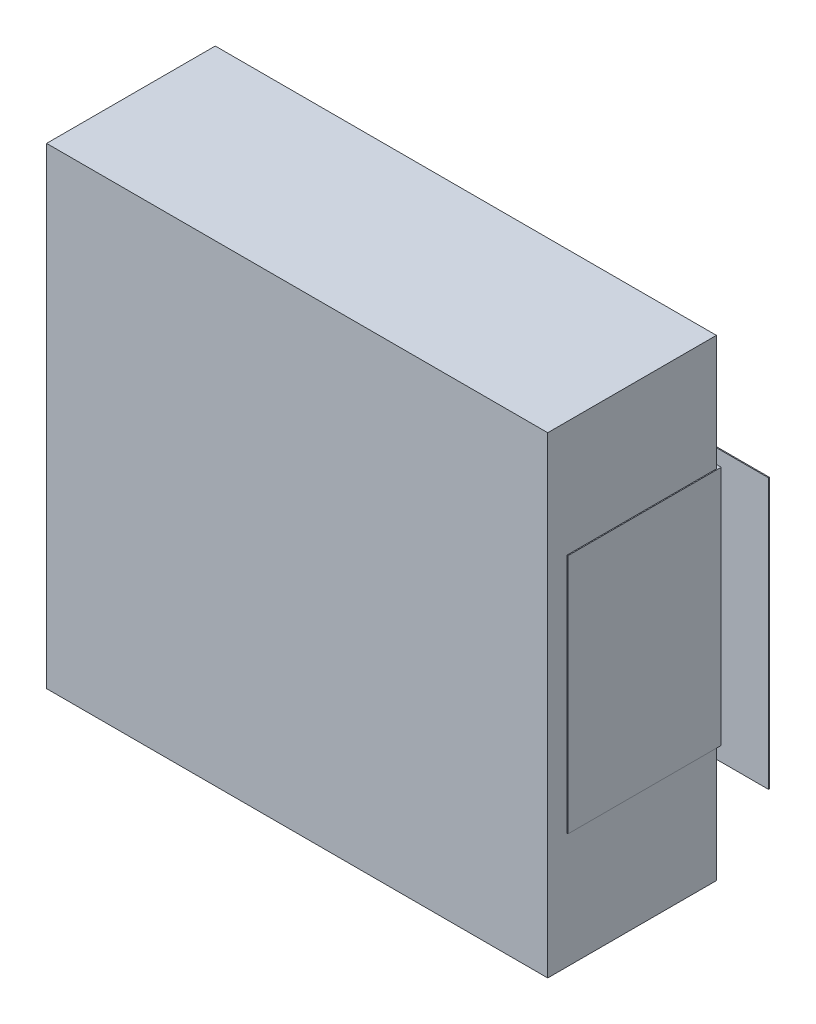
ISO-10303-21;
HEADER;
FILE_DESCRIPTION(('STEP AP214'),'2;1');
FILE_NAME('part.step','',(''),(''),'','','');
FILE_SCHEMA(('AUTOMOTIVE_DESIGN { 1 0 10303 214 1 1 1 1 }'));
ENDSEC;
DATA;
#1=APPLICATION_CONTEXT('core data for automotive mechanical design processes');
#2=APPLICATION_PROTOCOL_DEFINITION('international standard','automotive_design',2000,#1);
#3=PRODUCT_CONTEXT('',#1,'mechanical');
#4=PRODUCT('Part','Part','',(#3));
#5=PRODUCT_RELATED_PRODUCT_CATEGORY('part','',(#4));
#6=PRODUCT_DEFINITION_FORMATION('','',#4);
#7=PRODUCT_DEFINITION_CONTEXT('part definition',#1,'design');
#8=PRODUCT_DEFINITION('design','',#6,#7);
#9=PRODUCT_DEFINITION_SHAPE('','',#8);
#10=(LENGTH_UNIT() NAMED_UNIT(*) SI_UNIT(.MILLI.,.METRE.));
#11=(NAMED_UNIT(*) PLANE_ANGLE_UNIT() SI_UNIT($,.RADIAN.));
#12=(NAMED_UNIT(*) SI_UNIT($,.STERADIAN.) SOLID_ANGLE_UNIT());
#13=UNCERTAINTY_MEASURE_WITH_UNIT(LENGTH_MEASURE(1.E-05),#10,'distance_accuracy_value','');
#14=(GEOMETRIC_REPRESENTATION_CONTEXT(3) GLOBAL_UNCERTAINTY_ASSIGNED_CONTEXT((#13)) GLOBAL_UNIT_ASSIGNED_CONTEXT((#10,
#11,#12)) REPRESENTATION_CONTEXT('',''));
#15=CARTESIAN_POINT('',(0.,0.,0.));
#16=DIRECTION('',(0.,0.,1.));
#17=DIRECTION('',(1.,0.,0.));
#18=AXIS2_PLACEMENT_3D('',#15,#16,#17);
#19=CARTESIAN_POINT('',(0.,0.,0.0762));
#20=DIRECTION('',(0.,0.,1.));
#21=DIRECTION('',(1.,0.,0.));
#22=AXIS2_PLACEMENT_3D('',#19,#20,#21);
#23=PLANE('',#22);
#24=DIRECTION('',(0.,1.,0.));
#25=VECTOR('',#24,1.);
#26=CARTESIAN_POINT('',(1.09999999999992,1.39999999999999,0.0762));
#27=LINE('',#26,#25);
#28=CARTESIAN_POINT('',(1.09999999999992,1.39999999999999,0.0762));
#29=VERTEX_POINT('',#28);
#30=CARTESIAN_POINT('',(1.09999999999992,-1.39999999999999,0.0762));
#31=VERTEX_POINT('',#30);
#32=EDGE_CURVE('E175',#29,#31,#27,.F.);
#33=ORIENTED_EDGE('',*,*,#32,.F.);
#34=DIRECTION('',(1.,0.,0.));
#35=VECTOR('',#34,1.);
#36=CARTESIAN_POINT('',(3.1000000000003,1.39999999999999,0.0762));
#37=LINE('',#36,#35);
#38=CARTESIAN_POINT('',(3.1000000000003,1.39999999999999,0.0762));
#39=VERTEX_POINT('',#38);
#40=EDGE_CURVE('E19',#39,#29,#37,.F.);
#41=ORIENTED_EDGE('',*,*,#40,.F.);
#42=DIRECTION('',(0.,1.,0.));
#43=VECTOR('',#42,1.);
#44=CARTESIAN_POINT('',(3.1000000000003,-1.39999999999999,0.0762));
#45=LINE('',#44,#43);
#46=CARTESIAN_POINT('',(3.1000000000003,-1.39999999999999,0.0762));
#47=VERTEX_POINT('',#46);
#48=EDGE_CURVE('E203',#47,#39,#45,.T.);
#49=ORIENTED_EDGE('',*,*,#48,.F.);
#50=DIRECTION('',(1.,0.,0.));
#51=VECTOR('',#50,1.);
#52=CARTESIAN_POINT('',(1.09999999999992,-1.39999999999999,0.0762));
#53=LINE('',#52,#51);
#54=EDGE_CURVE('E188',#31,#47,#53,.T.);
#55=ORIENTED_EDGE('',*,*,#54,.F.);
#56=EDGE_LOOP('',(#33,#41,#49,#55));
#57=FACE_BOUND('',#56,.T.);
#58=ADVANCED_FACE('F16',(#57),#23,.F.);
#59=CARTESIAN_POINT('',(0.,0.,0.0762));
#60=DIRECTION('',(0.,0.,1.));
#61=DIRECTION('',(1.,0.,0.));
#62=AXIS2_PLACEMENT_3D('',#59,#60,#61);
#63=PLANE('',#62);
#64=DIRECTION('',(0.,1.,0.));
#65=VECTOR('',#64,1.);
#66=CARTESIAN_POINT('',(-1.09999999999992,-1.39999999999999,0.0762));
#67=LINE('',#66,#65);
#68=CARTESIAN_POINT('',(-1.09999999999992,-1.39999999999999,0.0762));
#69=VERTEX_POINT('',#68);
#70=CARTESIAN_POINT('',(-1.09999999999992,1.39999999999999,0.0762));
#71=VERTEX_POINT('',#70);
#72=EDGE_CURVE('E210',#69,#71,#67,.T.);
#73=ORIENTED_EDGE('',*,*,#72,.F.);
#74=DIRECTION('',(1.,0.,0.));
#75=VECTOR('',#74,1.);
#76=CARTESIAN_POINT('',(-3.1000000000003,-1.39999999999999,0.0762));
#77=LINE('',#76,#75);
#78=CARTESIAN_POINT('',(-3.1000000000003,-1.39999999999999,0.0762));
#79=VERTEX_POINT('',#78);
#80=EDGE_CURVE('E205',#79,#69,#77,.T.);
#81=ORIENTED_EDGE('',*,*,#80,.F.);
#82=DIRECTION('',(0.,1.,0.));
#83=VECTOR('',#82,1.);
#84=CARTESIAN_POINT('',(-3.1000000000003,1.39999999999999,0.0762));
#85=LINE('',#84,#83);
#86=CARTESIAN_POINT('',(-3.1000000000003,1.39999999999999,0.0762));
#87=VERTEX_POINT('',#86);
#88=EDGE_CURVE('E223',#87,#79,#85,.F.);
#89=ORIENTED_EDGE('',*,*,#88,.F.);
#90=DIRECTION('',(1.,0.,0.));
#91=VECTOR('',#90,1.);
#92=CARTESIAN_POINT('',(-1.09999999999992,1.39999999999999,0.0762));
#93=LINE('',#92,#91);
#94=EDGE_CURVE('E215',#71,#87,#93,.F.);
#95=ORIENTED_EDGE('',*,*,#94,.F.);
#96=EDGE_LOOP('',(#73,#81,#89,#95));
#97=FACE_BOUND('',#96,.T.);
#98=ADVANCED_FACE('F491',(#97),#63,.F.);
#99=CARTESIAN_POINT('',(3.1000000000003,1.39999999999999,0.0762));
#100=DIRECTION('',(0.,1.,0.));
#101=DIRECTION('',(0.,0.,1.));
#102=AXIS2_PLACEMENT_3D('',#99,#100,#101);
#103=PLANE('',#102);
#104=DIRECTION('',(0.,0.,-1.));
#105=VECTOR('',#104,1.);
#106=CARTESIAN_POINT('',(3.1000000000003,1.39999999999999,0.0762));
#107=LINE('',#106,#105);
#108=CARTESIAN_POINT('',(3.1000000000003,1.39999999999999,0.0862000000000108));
#109=VERTEX_POINT('',#108);
#110=EDGE_CURVE('E184',#39,#109,#107,.F.);
#111=ORIENTED_EDGE('',*,*,#110,.F.);
#112=ORIENTED_EDGE('',*,*,#40,.T.);
#113=DIRECTION('',(0.,0.,1.));
#114=VECTOR('',#113,1.);
#115=CARTESIAN_POINT('',(1.09999999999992,1.39999999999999,0.0762));
#116=LINE('',#115,#114);
#117=CARTESIAN_POINT('',(1.09999999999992,1.39999999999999,0.0862000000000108));
#118=VERTEX_POINT('',#117);
#119=EDGE_CURVE('E181',#118,#29,#116,.F.);
#120=ORIENTED_EDGE('',*,*,#119,.F.);
#121=DIRECTION('',(1.,0.,0.));
#122=VECTOR('',#121,1.);
#123=CARTESIAN_POINT('',(0.,1.39999999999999,0.0862000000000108));
#124=LINE('',#123,#122);
#125=EDGE_CURVE('E226',#109,#118,#124,.F.);
#126=ORIENTED_EDGE('',*,*,#125,.F.);
#127=EDGE_LOOP('',(#111,#112,#120,#126));
#128=FACE_BOUND('',#127,.T.);
#129=ADVANCED_FACE('F180',(#128),#103,.T.);
#130=CARTESIAN_POINT('',(1.09999999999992,1.39999999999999,0.0762));
#131=DIRECTION('',(-1.,0.,0.));
#132=DIRECTION('',(0.,0.,1.));
#133=AXIS2_PLACEMENT_3D('',#130,#131,#132);
#134=PLANE('',#133);
#135=ORIENTED_EDGE('',*,*,#119,.T.);
#136=ORIENTED_EDGE('',*,*,#32,.T.);
#137=DIRECTION('',(0.,0.,-1.));
#138=VECTOR('',#137,1.);
#139=CARTESIAN_POINT('',(1.09999999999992,-1.39999999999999,0.0762));
#140=LINE('',#139,#138);
#141=CARTESIAN_POINT('',(1.09999999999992,-1.39999999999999,0.0862000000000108));
#142=VERTEX_POINT('',#141);
#143=EDGE_CURVE('E190',#142,#31,#140,.T.);
#144=ORIENTED_EDGE('',*,*,#143,.F.);
#145=DIRECTION('',(0.,1.,0.));
#146=VECTOR('',#145,1.);
#147=CARTESIAN_POINT('',(1.09999999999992,0.,0.0862000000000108));
#148=LINE('',#147,#146);
#149=EDGE_CURVE('E194',#118,#142,#148,.F.);
#150=ORIENTED_EDGE('',*,*,#149,.F.);
#151=EDGE_LOOP('',(#135,#136,#144,#150));
#152=FACE_BOUND('',#151,.T.);
#153=ADVANCED_FACE('F192',(#152),#134,.T.);
#154=CARTESIAN_POINT('',(1.09999999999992,-1.39999999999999,0.0762));
#155=DIRECTION('',(0.,-1.,0.));
#156=DIRECTION('',(0.,0.,-1.));
#157=AXIS2_PLACEMENT_3D('',#154,#155,#156);
#158=PLANE('',#157);
#159=ORIENTED_EDGE('',*,*,#143,.T.);
#160=ORIENTED_EDGE('',*,*,#54,.T.);
#161=DIRECTION('',(0.,0.,-1.));
#162=VECTOR('',#161,1.);
#163=CARTESIAN_POINT('',(3.1000000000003,-1.39999999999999,0.0762));
#164=LINE('',#163,#162);
#165=CARTESIAN_POINT('',(3.1000000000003,-1.39999999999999,0.0862000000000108));
#166=VERTEX_POINT('',#165);
#167=EDGE_CURVE('E200',#166,#47,#164,.T.);
#168=ORIENTED_EDGE('',*,*,#167,.F.);
#169=DIRECTION('',(1.,0.,0.));
#170=VECTOR('',#169,1.);
#171=CARTESIAN_POINT('',(0.,-1.39999999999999,0.0862000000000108));
#172=LINE('',#171,#170);
#173=EDGE_CURVE('E229',#142,#166,#172,.T.);
#174=ORIENTED_EDGE('',*,*,#173,.F.);
#175=EDGE_LOOP('',(#159,#160,#168,#174));
#176=FACE_BOUND('',#175,.T.);
#177=ADVANCED_FACE('F501',(#176),#158,.T.);
#178=CARTESIAN_POINT('',(3.1000000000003,-1.39999999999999,0.0762));
#179=DIRECTION('',(1.,0.,0.));
#180=DIRECTION('',(0.,0.,-1.));
#181=AXIS2_PLACEMENT_3D('',#178,#179,#180);
#182=PLANE('',#181);
#183=ORIENTED_EDGE('',*,*,#167,.T.);
#184=ORIENTED_EDGE('',*,*,#48,.T.);
#185=ORIENTED_EDGE('',*,*,#110,.T.);
#186=DIRECTION('',(0.,1.,0.));
#187=VECTOR('',#186,1.);
#188=CARTESIAN_POINT('',(3.1000000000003,0.,0.0862000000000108));
#189=LINE('',#188,#187);
#190=EDGE_CURVE('E232',#166,#109,#189,.T.);
#191=ORIENTED_EDGE('',*,*,#190,.F.);
#192=EDGE_LOOP('',(#183,#184,#185,#191));
#193=FACE_BOUND('',#192,.T.);
#194=ADVANCED_FACE('F504',(#193),#182,.T.);
#195=CARTESIAN_POINT('',(-3.1000000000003,-1.39999999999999,0.0762));
#196=DIRECTION('',(0.,-1.,0.));
#197=DIRECTION('',(0.,0.,-1.));
#198=AXIS2_PLACEMENT_3D('',#195,#196,#197);
#199=PLANE('',#198);
#200=DIRECTION('',(0.,0.,1.));
#201=VECTOR('',#200,1.);
#202=CARTESIAN_POINT('',(-3.1000000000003,-1.39999999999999,0.0762));
#203=LINE('',#202,#201);
#204=CARTESIAN_POINT('',(-3.1000000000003,-1.39999999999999,0.0862000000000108));
#205=VERTEX_POINT('',#204);
#206=EDGE_CURVE('E217',#79,#205,#203,.T.);
#207=ORIENTED_EDGE('',*,*,#206,.F.);
#208=ORIENTED_EDGE('',*,*,#80,.T.);
#209=DIRECTION('',(0.,0.,-1.));
#210=VECTOR('',#209,1.);
#211=CARTESIAN_POINT('',(-1.09999999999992,-1.39999999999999,0.0762));
#212=LINE('',#211,#210);
#213=CARTESIAN_POINT('',(-1.09999999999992,-1.39999999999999,0.0862000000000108));
#214=VERTEX_POINT('',#213);
#215=EDGE_CURVE('E207',#214,#69,#212,.T.);
#216=ORIENTED_EDGE('',*,*,#215,.F.);
#217=DIRECTION('',(1.,0.,0.));
#218=VECTOR('',#217,1.);
#219=CARTESIAN_POINT('',(0.,-1.39999999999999,0.0862000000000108));
#220=LINE('',#219,#218);
#221=EDGE_CURVE('E239',#205,#214,#220,.T.);
#222=ORIENTED_EDGE('',*,*,#221,.F.);
#223=EDGE_LOOP('',(#207,#208,#216,#222));
#224=FACE_BOUND('',#223,.T.);
#225=ADVANCED_FACE('F486',(#224),#199,.T.);
#226=CARTESIAN_POINT('',(-1.09999999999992,-1.39999999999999,0.0762));
#227=DIRECTION('',(1.,0.,0.));
#228=DIRECTION('',(0.,0.,-1.));
#229=AXIS2_PLACEMENT_3D('',#226,#227,#228);
#230=PLANE('',#229);
#231=ORIENTED_EDGE('',*,*,#215,.T.);
#232=ORIENTED_EDGE('',*,*,#72,.T.);
#233=DIRECTION('',(0.,0.,1.));
#234=VECTOR('',#233,1.);
#235=CARTESIAN_POINT('',(-1.09999999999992,1.39999999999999,0.0762));
#236=LINE('',#235,#234);
#237=CARTESIAN_POINT('',(-1.09999999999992,1.39999999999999,0.0862000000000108));
#238=VERTEX_POINT('',#237);
#239=EDGE_CURVE('E212',#238,#71,#236,.F.);
#240=ORIENTED_EDGE('',*,*,#239,.F.);
#241=DIRECTION('',(0.,1.,0.));
#242=VECTOR('',#241,1.);
#243=CARTESIAN_POINT('',(-1.09999999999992,0.,0.0862000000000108));
#244=LINE('',#243,#242);
#245=EDGE_CURVE('E242',#214,#238,#244,.T.);
#246=ORIENTED_EDGE('',*,*,#245,.F.);
#247=EDGE_LOOP('',(#231,#232,#240,#246));
#248=FACE_BOUND('',#247,.T.);
#249=ADVANCED_FACE('F489',(#248),#230,.T.);
#250=CARTESIAN_POINT('',(-1.09999999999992,1.39999999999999,0.0762));
#251=DIRECTION('',(0.,1.,0.));
#252=DIRECTION('',(0.,0.,1.));
#253=AXIS2_PLACEMENT_3D('',#250,#251,#252);
#254=PLANE('',#253);
#255=ORIENTED_EDGE('',*,*,#239,.T.);
#256=ORIENTED_EDGE('',*,*,#94,.T.);
#257=DIRECTION('',(0.,0.,1.));
#258=VECTOR('',#257,1.);
#259=CARTESIAN_POINT('',(-3.1000000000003,1.39999999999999,0.0762));
#260=LINE('',#259,#258);
#261=CARTESIAN_POINT('',(-3.1000000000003,1.39999999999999,0.0862000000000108));
#262=VERTEX_POINT('',#261);
#263=EDGE_CURVE('E220',#262,#87,#260,.F.);
#264=ORIENTED_EDGE('',*,*,#263,.F.);
#265=DIRECTION('',(1.,0.,0.));
#266=VECTOR('',#265,1.);
#267=CARTESIAN_POINT('',(0.,1.39999999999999,0.0862000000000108));
#268=LINE('',#267,#266);
#269=EDGE_CURVE('E245',#238,#262,#268,.F.);
#270=ORIENTED_EDGE('',*,*,#269,.F.);
#271=EDGE_LOOP('',(#255,#256,#264,#270));
#272=FACE_BOUND('',#271,.T.);
#273=ADVANCED_FACE('F479',(#272),#254,.T.);
#274=CARTESIAN_POINT('',(-3.1000000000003,1.39999999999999,0.0762));
#275=DIRECTION('',(-1.,0.,0.));
#276=DIRECTION('',(0.,0.,1.));
#277=AXIS2_PLACEMENT_3D('',#274,#275,#276);
#278=PLANE('',#277);
#279=ORIENTED_EDGE('',*,*,#263,.T.);
#280=ORIENTED_EDGE('',*,*,#88,.T.);
#281=ORIENTED_EDGE('',*,*,#206,.T.);
#282=DIRECTION('',(0.,1.,0.));
#283=VECTOR('',#282,1.);
#284=CARTESIAN_POINT('',(-3.1000000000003,0.,0.0862000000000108));
#285=LINE('',#284,#283);
#286=EDGE_CURVE('E248',#262,#205,#285,.F.);
#287=ORIENTED_EDGE('',*,*,#286,.F.);
#288=EDGE_LOOP('',(#279,#280,#281,#287));
#289=FACE_BOUND('',#288,.T.);
#290=ADVANCED_FACE('F483',(#289),#278,.T.);
#291=CARTESIAN_POINT('',(0.,0.,0.0862000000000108));
#292=DIRECTION('',(0.,0.,1.));
#293=DIRECTION('',(1.,0.,0.));
#294=AXIS2_PLACEMENT_3D('',#291,#292,#293);
#295=PLANE('',#294);
#296=DIRECTION('',(1.,0.,0.));
#297=VECTOR('',#296,1.);
#298=CARTESIAN_POINT('',(0.,-1.25000000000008,0.0862000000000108));
#299=LINE('',#298,#297);
#300=CARTESIAN_POINT('',(2.60999999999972,-1.25000000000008,0.0862000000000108));
#301=VERTEX_POINT('',#300);
#302=CARTESIAN_POINT('',(1.25000000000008,-1.25000000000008,0.0862000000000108));
#303=VERTEX_POINT('',#302);
#304=EDGE_CURVE('E237',#301,#303,#299,.F.);
#305=ORIENTED_EDGE('',*,*,#304,.T.);
#306=DIRECTION('',(0.,1.,0.));
#307=VECTOR('',#306,1.);
#308=CARTESIAN_POINT('',(1.25000000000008,1.25000000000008,0.0862000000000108));
#309=LINE('',#308,#307);
#310=CARTESIAN_POINT('',(1.25000000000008,1.25000000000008,0.0862000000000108));
#311=VERTEX_POINT('',#310);
#312=EDGE_CURVE('E259',#311,#303,#309,.F.);
#313=ORIENTED_EDGE('',*,*,#312,.F.);
#314=DIRECTION('',(1.,0.,0.));
#315=VECTOR('',#314,1.);
#316=CARTESIAN_POINT('',(0.,1.25000000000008,0.0862000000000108));
#317=LINE('',#316,#315);
#318=CARTESIAN_POINT('',(2.60999999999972,1.25000000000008,0.0862000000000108));
#319=VERTEX_POINT('',#318);
#320=EDGE_CURVE('E235',#311,#319,#317,.T.);
#321=ORIENTED_EDGE('',*,*,#320,.T.);
#322=DIRECTION('',(0.,1.,0.));
#323=VECTOR('',#322,1.);
#324=CARTESIAN_POINT('',(2.60999999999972,-1.25000000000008,0.0862000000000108));
#325=LINE('',#324,#323);
#326=EDGE_CURVE('E256',#301,#319,#325,.T.);
#327=ORIENTED_EDGE('',*,*,#326,.F.);
#328=EDGE_LOOP('',(#305,#313,#321,#327));
#329=FACE_BOUND('',#328,.T.);
#330=ORIENTED_EDGE('',*,*,#173,.T.);
#331=ORIENTED_EDGE('',*,*,#190,.T.);
#332=ORIENTED_EDGE('',*,*,#125,.T.);
#333=ORIENTED_EDGE('',*,*,#149,.T.);
#334=EDGE_LOOP('',(#330,#331,#332,#333));
#335=FACE_BOUND('',#334,.T.);
#336=ADVANCED_FACE('F410',(#329,#335),#295,.T.);
#337=CARTESIAN_POINT('',(0.,0.,0.0862000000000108));
#338=DIRECTION('',(0.,0.,1.));
#339=DIRECTION('',(1.,0.,0.));
#340=AXIS2_PLACEMENT_3D('',#337,#338,#339);
#341=PLANE('',#340);
#342=DIRECTION('',(0.,1.,0.));
#343=VECTOR('',#342,1.);
#344=CARTESIAN_POINT('',(-2.60999999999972,1.25000000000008,0.0862000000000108));
#345=LINE('',#344,#343);
#346=CARTESIAN_POINT('',(-2.60999999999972,1.25000000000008,0.0862000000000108));
#347=VERTEX_POINT('',#346);
#348=CARTESIAN_POINT('',(-2.60999999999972,-1.25000000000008,0.0862000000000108));
#349=VERTEX_POINT('',#348);
#350=EDGE_CURVE('E270',#347,#349,#345,.F.);
#351=ORIENTED_EDGE('',*,*,#350,.F.);
#352=DIRECTION('',(1.,0.,0.));
#353=VECTOR('',#352,1.);
#354=CARTESIAN_POINT('',(0.,1.25000000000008,0.0862000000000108));
#355=LINE('',#354,#353);
#356=CARTESIAN_POINT('',(-1.25000000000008,1.25000000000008,0.0862000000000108));
#357=VERTEX_POINT('',#356);
#358=EDGE_CURVE('E253',#347,#357,#355,.T.);
#359=ORIENTED_EDGE('',*,*,#358,.T.);
#360=DIRECTION('',(0.,1.,0.));
#361=VECTOR('',#360,1.);
#362=CARTESIAN_POINT('',(-1.25000000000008,-1.25000000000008,0.0862000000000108));
#363=LINE('',#362,#361);
#364=CARTESIAN_POINT('',(-1.25000000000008,-1.25000000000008,0.0862000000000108));
#365=VERTEX_POINT('',#364);
#366=EDGE_CURVE('E267',#365,#357,#363,.T.);
#367=ORIENTED_EDGE('',*,*,#366,.F.);
#368=DIRECTION('',(1.,0.,0.));
#369=VECTOR('',#368,1.);
#370=CARTESIAN_POINT('',(0.,-1.25000000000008,0.0862000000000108));
#371=LINE('',#370,#369);
#372=EDGE_CURVE('E251',#365,#349,#371,.F.);
#373=ORIENTED_EDGE('',*,*,#372,.T.);
#374=EDGE_LOOP('',(#351,#359,#367,#373));
#375=FACE_BOUND('',#374,.T.);
#376=ORIENTED_EDGE('',*,*,#269,.T.);
#377=ORIENTED_EDGE('',*,*,#286,.T.);
#378=ORIENTED_EDGE('',*,*,#221,.T.);
#379=ORIENTED_EDGE('',*,*,#245,.T.);
#380=EDGE_LOOP('',(#376,#377,#378,#379));
#381=FACE_BOUND('',#380,.T.);
#382=ADVANCED_FACE('F415',(#375,#381),#341,.T.);
#383=CARTESIAN_POINT('',(2.60999999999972,-1.25000000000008,0.0762));
#384=DIRECTION('',(1.,0.,0.));
#385=DIRECTION('',(0.,0.,-1.));
#386=AXIS2_PLACEMENT_3D('',#383,#384,#385);
#387=PLANE('',#386);
#388=DIRECTION('',(0.,0.,-1.));
#389=VECTOR('',#388,1.);
#390=CARTESIAN_POINT('',(2.60999999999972,-1.25000000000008,0.0762));
#391=LINE('',#390,#389);
#392=CARTESIAN_POINT('',(2.60999999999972,-1.25000000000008,1.67619999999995));
#393=VERTEX_POINT('',#392);
#394=EDGE_CURVE('E279',#301,#393,#391,.F.);
#395=ORIENTED_EDGE('',*,*,#394,.F.);
#396=ORIENTED_EDGE('',*,*,#326,.T.);
#397=DIRECTION('',(0.,0.,1.));
#398=VECTOR('',#397,1.);
#399=CARTESIAN_POINT('',(2.60999999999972,1.25000000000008,0.0762));
#400=LINE('',#399,#398);
#401=CARTESIAN_POINT('',(2.60999999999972,1.25000000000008,1.67619999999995));
#402=VERTEX_POINT('',#401);
#403=EDGE_CURVE('E276',#402,#319,#400,.F.);
#404=ORIENTED_EDGE('',*,*,#403,.F.);
#405=DIRECTION('',(0.,1.,0.));
#406=VECTOR('',#405,1.);
#407=CARTESIAN_POINT('',(2.60999999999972,0.,1.67619999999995));
#408=LINE('',#407,#406);
#409=EDGE_CURVE('E287',#393,#402,#408,.T.);
#410=ORIENTED_EDGE('',*,*,#409,.F.);
#411=EDGE_LOOP('',(#395,#396,#404,#410));
#412=FACE_BOUND('',#411,.T.);
#413=ADVANCED_FACE('F413',(#412),#387,.T.);
#414=CARTESIAN_POINT('',(1.25000000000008,1.25000000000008,0.0762));
#415=DIRECTION('',(-1.,0.,0.));
#416=DIRECTION('',(0.,0.,1.));
#417=AXIS2_PLACEMENT_3D('',#414,#415,#416);
#418=PLANE('',#417);
#419=DIRECTION('',(0.,0.,1.));
#420=VECTOR('',#419,1.);
#421=CARTESIAN_POINT('',(1.25000000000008,1.25000000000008,0.0762));
#422=LINE('',#421,#420);
#423=CARTESIAN_POINT('',(1.25000000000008,1.25000000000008,0.126200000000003));
#424=VERTEX_POINT('',#423);
#425=EDGE_CURVE('E273',#311,#424,#422,.T.);
#426=ORIENTED_EDGE('',*,*,#425,.F.);
#427=ORIENTED_EDGE('',*,*,#312,.T.);
#428=DIRECTION('',(0.,0.,-1.));
#429=VECTOR('',#428,1.);
#430=CARTESIAN_POINT('',(1.25000000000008,-1.25000000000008,0.0762));
#431=LINE('',#430,#429);
#432=CARTESIAN_POINT('',(1.25000000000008,-1.25000000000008,0.126200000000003));
#433=VERTEX_POINT('',#432);
#434=EDGE_CURVE('E281',#433,#303,#431,.T.);
#435=ORIENTED_EDGE('',*,*,#434,.F.);
#436=DIRECTION('',(0.,1.,0.));
#437=VECTOR('',#436,1.);
#438=CARTESIAN_POINT('',(1.25000000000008,0.,0.126200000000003));
#439=LINE('',#438,#437);
#440=EDGE_CURVE('E293',#433,#424,#439,.T.);
#441=ORIENTED_EDGE('',*,*,#440,.T.);
#442=EDGE_LOOP('',(#426,#427,#435,#441));
#443=FACE_BOUND('',#442,.T.);
#444=ADVANCED_FACE('F407',(#443),#418,.T.);
#445=CARTESIAN_POINT('',(-1.25000000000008,-1.25000000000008,0.0762));
#446=DIRECTION('',(1.,0.,0.));
#447=DIRECTION('',(0.,0.,-1.));
#448=AXIS2_PLACEMENT_3D('',#445,#446,#447);
#449=PLANE('',#448);
#450=DIRECTION('',(0.,0.,-1.));
#451=VECTOR('',#450,1.);
#452=CARTESIAN_POINT('',(-1.25000000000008,-1.25000000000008,0.0762));
#453=LINE('',#452,#451);
#454=CARTESIAN_POINT('',(-1.25000000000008,-1.25000000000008,0.126200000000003));
#455=VERTEX_POINT('',#454);
#456=EDGE_CURVE('E264',#455,#365,#453,.T.);
#457=ORIENTED_EDGE('',*,*,#456,.T.);
#458=ORIENTED_EDGE('',*,*,#366,.T.);
#459=DIRECTION('',(0.,0.,-1.));
#460=VECTOR('',#459,1.);
#461=CARTESIAN_POINT('',(-1.25000000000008,1.25000000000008,0.0762));
#462=LINE('',#461,#460);
#463=CARTESIAN_POINT('',(-1.25000000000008,1.25000000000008,0.126200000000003));
#464=VERTEX_POINT('',#463);
#465=EDGE_CURVE('E262',#357,#464,#462,.F.);
#466=ORIENTED_EDGE('',*,*,#465,.T.);
#467=DIRECTION('',(0.,1.,0.));
#468=VECTOR('',#467,1.);
#469=CARTESIAN_POINT('',(-1.25000000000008,0.,0.126200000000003));
#470=LINE('',#469,#468);
#471=EDGE_CURVE('E299',#464,#455,#470,.F.);
#472=ORIENTED_EDGE('',*,*,#471,.T.);
#473=EDGE_LOOP('',(#457,#458,#466,#472));
#474=FACE_BOUND('',#473,.T.);
#475=ADVANCED_FACE('F422',(#474),#449,.T.);
#476=CARTESIAN_POINT('',(-2.60999999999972,1.25000000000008,0.0762));
#477=DIRECTION('',(-1.,0.,0.));
#478=DIRECTION('',(0.,0.,1.));
#479=AXIS2_PLACEMENT_3D('',#476,#477,#478);
#480=PLANE('',#479);
#481=DIRECTION('',(0.,0.,1.));
#482=VECTOR('',#481,1.);
#483=CARTESIAN_POINT('',(-2.60999999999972,1.25000000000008,0.0762));
#484=LINE('',#483,#482);
#485=CARTESIAN_POINT('',(-2.60999999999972,1.25000000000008,1.67619999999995));
#486=VERTEX_POINT('',#485);
#487=EDGE_CURVE('E313',#347,#486,#484,.T.);
#488=ORIENTED_EDGE('',*,*,#487,.F.);
#489=ORIENTED_EDGE('',*,*,#350,.T.);
#490=DIRECTION('',(0.,0.,-1.));
#491=VECTOR('',#490,1.);
#492=CARTESIAN_POINT('',(-2.60999999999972,-1.25000000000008,0.0762));
#493=LINE('',#492,#491);
#494=CARTESIAN_POINT('',(-2.60999999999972,-1.25000000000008,1.67619999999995));
#495=VERTEX_POINT('',#494);
#496=EDGE_CURVE('E310',#495,#349,#493,.T.);
#497=ORIENTED_EDGE('',*,*,#496,.F.);
#498=DIRECTION('',(0.,1.,0.));
#499=VECTOR('',#498,1.);
#500=CARTESIAN_POINT('',(-2.60999999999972,0.,1.67619999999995));
#501=LINE('',#500,#499);
#502=EDGE_CURVE('E321',#486,#495,#501,.F.);
#503=ORIENTED_EDGE('',*,*,#502,.F.);
#504=EDGE_LOOP('',(#488,#489,#497,#503));
#505=FACE_BOUND('',#504,.T.);
#506=ADVANCED_FACE('F459',(#505),#480,.T.);
#507=CARTESIAN_POINT('',(2.60999999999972,1.25000000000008,0.0762));
#508=DIRECTION('',(0.,1.,0.));
#509=DIRECTION('',(0.,0.,1.));
#510=AXIS2_PLACEMENT_3D('',#507,#508,#509);
#511=PLANE('',#510);
#512=ORIENTED_EDGE('',*,*,#403,.T.);
#513=ORIENTED_EDGE('',*,*,#320,.F.);
#514=ORIENTED_EDGE('',*,*,#425,.T.);
#515=DIRECTION('',(1.,0.,0.));
#516=VECTOR('',#515,1.);
#517=CARTESIAN_POINT('',(0.,1.25000000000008,0.126200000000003));
#518=LINE('',#517,#516);
#519=CARTESIAN_POINT('',(2.59999999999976,1.25000000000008,0.126200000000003));
#520=VERTEX_POINT('',#519);
#521=EDGE_CURVE('E295',#424,#520,#518,.T.);
#522=ORIENTED_EDGE('',*,*,#521,.T.);
#523=DIRECTION('',(0.,0.,-1.));
#524=VECTOR('',#523,1.);
#525=CARTESIAN_POINT('',(2.59999999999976,1.25000000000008,0.0762));
#526=LINE('',#525,#524);
#527=CARTESIAN_POINT('',(2.59999999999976,1.25000000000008,1.67619999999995));
#528=VERTEX_POINT('',#527);
#529=EDGE_CURVE('E329',#528,#520,#526,.T.);
#530=ORIENTED_EDGE('',*,*,#529,.F.);
#531=DIRECTION('',(1.,0.,0.));
#532=VECTOR('',#531,1.);
#533=CARTESIAN_POINT('',(0.,1.25000000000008,1.67619999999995));
#534=LINE('',#533,#532);
#535=EDGE_CURVE('E290',#402,#528,#534,.F.);
#536=ORIENTED_EDGE('',*,*,#535,.F.);
#537=EDGE_LOOP('',(#512,#513,#514,#522,#530,#536));
#538=FACE_BOUND('',#537,.T.);
#539=ADVANCED_FACE('F403',(#538),#511,.T.);
#540=CARTESIAN_POINT('',(1.25000000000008,-1.25000000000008,0.0762));
#541=DIRECTION('',(0.,-1.,0.));
#542=DIRECTION('',(0.,0.,-1.));
#543=AXIS2_PLACEMENT_3D('',#540,#541,#542);
#544=PLANE('',#543);
#545=ORIENTED_EDGE('',*,*,#434,.T.);
#546=ORIENTED_EDGE('',*,*,#304,.F.);
#547=ORIENTED_EDGE('',*,*,#394,.T.);
#548=DIRECTION('',(1.,0.,0.));
#549=VECTOR('',#548,1.);
#550=CARTESIAN_POINT('',(0.,-1.25000000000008,1.67619999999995));
#551=LINE('',#550,#549);
#552=CARTESIAN_POINT('',(2.59999999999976,-1.25000000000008,1.67619999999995));
#553=VERTEX_POINT('',#552);
#554=EDGE_CURVE('E284',#553,#393,#551,.T.);
#555=ORIENTED_EDGE('',*,*,#554,.F.);
#556=DIRECTION('',(0.,0.,-1.));
#557=VECTOR('',#556,1.);
#558=CARTESIAN_POINT('',(2.59999999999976,-1.25000000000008,0.0762));
#559=LINE('',#558,#557);
#560=CARTESIAN_POINT('',(2.59999999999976,-1.25000000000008,0.126200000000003));
#561=VERTEX_POINT('',#560);
#562=EDGE_CURVE('E340',#561,#553,#559,.F.);
#563=ORIENTED_EDGE('',*,*,#562,.F.);
#564=DIRECTION('',(1.,0.,0.));
#565=VECTOR('',#564,1.);
#566=CARTESIAN_POINT('',(0.,-1.25000000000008,0.126200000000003));
#567=LINE('',#566,#565);
#568=EDGE_CURVE('E304',#561,#433,#567,.F.);
#569=ORIENTED_EDGE('',*,*,#568,.T.);
#570=EDGE_LOOP('',(#545,#546,#547,#555,#563,#569));
#571=FACE_BOUND('',#570,.T.);
#572=ADVANCED_FACE('F395',(#571),#544,.T.);
#573=CARTESIAN_POINT('',(0.,0.,1.67619999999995));
#574=DIRECTION('',(0.,0.,1.));
#575=DIRECTION('',(1.,0.,0.));
#576=AXIS2_PLACEMENT_3D('',#573,#574,#575);
#577=PLANE('',#576);
#578=ORIENTED_EDGE('',*,*,#535,.T.);
#579=DIRECTION('',(0.,1.,0.));
#580=VECTOR('',#579,1.);
#581=CARTESIAN_POINT('',(2.59999999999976,-2.45000000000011,1.67619999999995));
#582=LINE('',#581,#580);
#583=EDGE_CURVE('E343',#553,#528,#582,.T.);
#584=ORIENTED_EDGE('',*,*,#583,.F.);
#585=ORIENTED_EDGE('',*,*,#554,.T.);
#586=ORIENTED_EDGE('',*,*,#409,.T.);
#587=EDGE_LOOP('',(#578,#584,#585,#586));
#588=FACE_BOUND('',#587,.T.);
#589=ADVANCED_FACE('F400',(#588),#577,.T.);
#590=CARTESIAN_POINT('',(0.,0.,0.126200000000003));
#591=DIRECTION('',(0.,0.,1.));
#592=DIRECTION('',(1.,0.,0.));
#593=AXIS2_PLACEMENT_3D('',#590,#591,#592);
#594=PLANE('',#593);
#595=DIRECTION('',(0.,1.,0.));
#596=VECTOR('',#595,1.);
#597=CARTESIAN_POINT('',(2.59999999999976,-2.45000000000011,0.126200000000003));
#598=LINE('',#597,#596);
#599=CARTESIAN_POINT('',(2.59999999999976,-2.45000000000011,0.126200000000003));
#600=VERTEX_POINT('',#599);
#601=EDGE_CURVE('E337',#600,#561,#598,.T.);
#602=ORIENTED_EDGE('',*,*,#601,.F.);
#603=DIRECTION('',(1.,0.,0.));
#604=VECTOR('',#603,1.);
#605=CARTESIAN_POINT('',(-2.59999999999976,-2.45000000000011,0.126200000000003));
#606=LINE('',#605,#604);
#607=CARTESIAN_POINT('',(-2.59999999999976,-2.45000000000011,0.126200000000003));
#608=VERTEX_POINT('',#607);
#609=EDGE_CURVE('E327',#608,#600,#606,.T.);
#610=ORIENTED_EDGE('',*,*,#609,.F.);
#611=DIRECTION('',(0.,1.,0.));
#612=VECTOR('',#611,1.);
#613=CARTESIAN_POINT('',(-2.59999999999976,0.,0.126200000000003));
#614=LINE('',#613,#612);
#615=CARTESIAN_POINT('',(-2.59999999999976,-1.25000000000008,0.126200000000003));
#616=VERTEX_POINT('',#615);
#617=EDGE_CURVE('E302',#616,#608,#614,.F.);
#618=ORIENTED_EDGE('',*,*,#617,.F.);
#619=DIRECTION('',(1.,0.,0.));
#620=VECTOR('',#619,1.);
#621=CARTESIAN_POINT('',(-2.60999999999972,-1.25000000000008,0.126200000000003));
#622=LINE('',#621,#620);
#623=EDGE_CURVE('E307',#455,#616,#622,.F.);
#624=ORIENTED_EDGE('',*,*,#623,.F.);
#625=ORIENTED_EDGE('',*,*,#471,.F.);
#626=DIRECTION('',(1.,0.,0.));
#627=VECTOR('',#626,1.);
#628=CARTESIAN_POINT('',(-1.25000000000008,1.25000000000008,0.126200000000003));
#629=LINE('',#628,#627);
#630=CARTESIAN_POINT('',(-2.59999999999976,1.25000000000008,0.126200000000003));
#631=VERTEX_POINT('',#630);
#632=EDGE_CURVE('E315',#631,#464,#629,.T.);
#633=ORIENTED_EDGE('',*,*,#632,.F.);
#634=DIRECTION('',(0.,1.,0.));
#635=VECTOR('',#634,1.);
#636=CARTESIAN_POINT('',(-2.59999999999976,0.,0.126200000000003));
#637=LINE('',#636,#635);
#638=CARTESIAN_POINT('',(-2.59999999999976,2.45000000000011,0.126200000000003));
#639=VERTEX_POINT('',#638);
#640=EDGE_CURVE('E297',#639,#631,#637,.F.);
#641=ORIENTED_EDGE('',*,*,#640,.F.);
#642=DIRECTION('',(1.,0.,0.));
#643=VECTOR('',#642,1.);
#644=CARTESIAN_POINT('',(2.59999999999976,2.45000000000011,0.126200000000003));
#645=LINE('',#644,#643);
#646=CARTESIAN_POINT('',(2.59999999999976,2.45000000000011,0.126200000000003));
#647=VERTEX_POINT('',#646);
#648=EDGE_CURVE('E349',#647,#639,#645,.F.);
#649=ORIENTED_EDGE('',*,*,#648,.F.);
#650=DIRECTION('',(0.,1.,0.));
#651=VECTOR('',#650,1.);
#652=CARTESIAN_POINT('',(2.59999999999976,-2.45000000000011,0.126200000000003));
#653=LINE('',#652,#651);
#654=EDGE_CURVE('E332',#520,#647,#653,.T.);
#655=ORIENTED_EDGE('',*,*,#654,.F.);
#656=ORIENTED_EDGE('',*,*,#521,.F.);
#657=ORIENTED_EDGE('',*,*,#440,.F.);
#658=ORIENTED_EDGE('',*,*,#568,.F.);
#659=EDGE_LOOP('',(#602,#610,#618,#624,#625,#633,#641,#649,#655,#656,#657,#658));
#660=FACE_BOUND('',#659,.T.);
#661=ADVANCED_FACE('F382',(#660),#594,.F.);
#662=CARTESIAN_POINT('',(-2.60999999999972,-1.25000000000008,0.0762));
#663=DIRECTION('',(0.,-1.,0.));
#664=DIRECTION('',(0.,0.,-1.));
#665=AXIS2_PLACEMENT_3D('',#662,#663,#664);
#666=PLANE('',#665);
#667=ORIENTED_EDGE('',*,*,#496,.T.);
#668=ORIENTED_EDGE('',*,*,#372,.F.);
#669=ORIENTED_EDGE('',*,*,#456,.F.);
#670=ORIENTED_EDGE('',*,*,#623,.T.);
#671=DIRECTION('',(0.,0.,1.));
#672=VECTOR('',#671,1.);
#673=CARTESIAN_POINT('',(-2.59999999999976,-1.25000000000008,0.0762));
#674=LINE('',#673,#672);
#675=CARTESIAN_POINT('',(-2.59999999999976,-1.25000000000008,1.67619999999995));
#676=VERTEX_POINT('',#675);
#677=EDGE_CURVE('E351',#676,#616,#674,.F.);
#678=ORIENTED_EDGE('',*,*,#677,.F.);
#679=DIRECTION('',(1.,0.,0.));
#680=VECTOR('',#679,1.);
#681=CARTESIAN_POINT('',(0.,-1.25000000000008,1.67619999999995));
#682=LINE('',#681,#680);
#683=EDGE_CURVE('E324',#495,#676,#682,.T.);
#684=ORIENTED_EDGE('',*,*,#683,.F.);
#685=EDGE_LOOP('',(#667,#668,#669,#670,#678,#684));
#686=FACE_BOUND('',#685,.T.);
#687=ADVANCED_FACE('F446',(#686),#666,.T.);
#688=CARTESIAN_POINT('',(-1.25000000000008,1.25000000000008,0.0762));
#689=DIRECTION('',(0.,1.,0.));
#690=DIRECTION('',(0.,0.,1.));
#691=AXIS2_PLACEMENT_3D('',#688,#689,#690);
#692=PLANE('',#691);
#693=ORIENTED_EDGE('',*,*,#465,.F.);
#694=ORIENTED_EDGE('',*,*,#358,.F.);
#695=ORIENTED_EDGE('',*,*,#487,.T.);
#696=DIRECTION('',(1.,0.,0.));
#697=VECTOR('',#696,1.);
#698=CARTESIAN_POINT('',(0.,1.25000000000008,1.67619999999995));
#699=LINE('',#698,#697);
#700=CARTESIAN_POINT('',(-2.59999999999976,1.25000000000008,1.67619999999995));
#701=VERTEX_POINT('',#700);
#702=EDGE_CURVE('E318',#701,#486,#699,.F.);
#703=ORIENTED_EDGE('',*,*,#702,.F.);
#704=DIRECTION('',(0.,0.,1.));
#705=VECTOR('',#704,1.);
#706=CARTESIAN_POINT('',(-2.59999999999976,1.25000000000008,0.0762));
#707=LINE('',#706,#705);
#708=EDGE_CURVE('E358',#631,#701,#707,.T.);
#709=ORIENTED_EDGE('',*,*,#708,.F.);
#710=ORIENTED_EDGE('',*,*,#632,.T.);
#711=EDGE_LOOP('',(#693,#694,#695,#703,#709,#710));
#712=FACE_BOUND('',#711,.T.);
#713=ADVANCED_FACE('F442',(#712),#692,.T.);
#714=CARTESIAN_POINT('',(0.,0.,1.67619999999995));
#715=DIRECTION('',(0.,0.,1.));
#716=DIRECTION('',(1.,0.,0.));
#717=AXIS2_PLACEMENT_3D('',#714,#715,#716);
#718=PLANE('',#717);
#719=ORIENTED_EDGE('',*,*,#683,.T.);
#720=DIRECTION('',(0.,1.,0.));
#721=VECTOR('',#720,1.);
#722=CARTESIAN_POINT('',(-2.59999999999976,2.45000000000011,1.67619999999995));
#723=LINE('',#722,#721);
#724=EDGE_CURVE('E361',#701,#676,#723,.F.);
#725=ORIENTED_EDGE('',*,*,#724,.F.);
#726=ORIENTED_EDGE('',*,*,#702,.T.);
#727=ORIENTED_EDGE('',*,*,#502,.T.);
#728=EDGE_LOOP('',(#719,#725,#726,#727));
#729=FACE_BOUND('',#728,.T.);
#730=ADVANCED_FACE('F439',(#729),#718,.T.);
#731=CARTESIAN_POINT('',(-2.59999999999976,-2.45000000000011,0.0762));
#732=DIRECTION('',(0.,-1.,0.));
#733=DIRECTION('',(0.,0.,-1.));
#734=AXIS2_PLACEMENT_3D('',#731,#732,#733);
#735=PLANE('',#734);
#736=DIRECTION('',(0.,0.,1.));
#737=VECTOR('',#736,1.);
#738=CARTESIAN_POINT('',(-2.59999999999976,-2.45000000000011,0.0762));
#739=LINE('',#738,#737);
#740=CARTESIAN_POINT('',(-2.59999999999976,-2.45000000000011,1.876298));
#741=VERTEX_POINT('',#740);
#742=EDGE_CURVE('E354',#608,#741,#739,.T.);
#743=ORIENTED_EDGE('',*,*,#742,.F.);
#744=ORIENTED_EDGE('',*,*,#609,.T.);
#745=DIRECTION('',(0.,0.,-1.));
#746=VECTOR('',#745,1.);
#747=CARTESIAN_POINT('',(2.59999999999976,-2.45000000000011,0.0762));
#748=LINE('',#747,#746);
#749=CARTESIAN_POINT('',(2.59999999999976,-2.45000000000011,1.876298));
#750=VERTEX_POINT('',#749);
#751=EDGE_CURVE('E334',#750,#600,#748,.T.);
#752=ORIENTED_EDGE('',*,*,#751,.F.);
#753=DIRECTION('',(1.,0.,0.));
#754=VECTOR('',#753,1.);
#755=CARTESIAN_POINT('',(0.,-2.45000000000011,1.876298));
#756=LINE('',#755,#754);
#757=EDGE_CURVE('E364',#741,#750,#756,.T.);
#758=ORIENTED_EDGE('',*,*,#757,.F.);
#759=EDGE_LOOP('',(#743,#744,#752,#758));
#760=FACE_BOUND('',#759,.T.);
#761=ADVANCED_FACE('F391',(#760),#735,.T.);
#762=CARTESIAN_POINT('',(2.59999999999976,-2.45000000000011,0.0762));
#763=DIRECTION('',(1.,0.,0.));
#764=DIRECTION('',(0.,0.,-1.));
#765=AXIS2_PLACEMENT_3D('',#762,#763,#764);
#766=PLANE('',#765);
#767=ORIENTED_EDGE('',*,*,#562,.T.);
#768=ORIENTED_EDGE('',*,*,#583,.T.);
#769=ORIENTED_EDGE('',*,*,#529,.T.);
#770=ORIENTED_EDGE('',*,*,#654,.T.);
#771=DIRECTION('',(0.,0.,1.));
#772=VECTOR('',#771,1.);
#773=CARTESIAN_POINT('',(2.59999999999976,2.45000000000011,0.0762));
#774=LINE('',#773,#772);
#775=CARTESIAN_POINT('',(2.59999999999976,2.45000000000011,1.876298));
#776=VERTEX_POINT('',#775);
#777=EDGE_CURVE('E346',#776,#647,#774,.F.);
#778=ORIENTED_EDGE('',*,*,#777,.F.);
#779=DIRECTION('',(0.,1.,0.));
#780=VECTOR('',#779,1.);
#781=CARTESIAN_POINT('',(2.59999999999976,0.,1.876298));
#782=LINE('',#781,#780);
#783=EDGE_CURVE('E367',#750,#776,#782,.T.);
#784=ORIENTED_EDGE('',*,*,#783,.F.);
#785=ORIENTED_EDGE('',*,*,#751,.T.);
#786=ORIENTED_EDGE('',*,*,#601,.T.);
#787=EDGE_LOOP('',(#767,#768,#769,#770,#778,#784,#785,#786));
#788=FACE_BOUND('',#787,.T.);
#789=ADVANCED_FACE('F377',(#788),#766,.T.);
#790=CARTESIAN_POINT('',(2.59999999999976,2.45000000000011,0.0762));
#791=DIRECTION('',(0.,1.,0.));
#792=DIRECTION('',(0.,0.,1.));
#793=AXIS2_PLACEMENT_3D('',#790,#791,#792);
#794=PLANE('',#793);
#795=ORIENTED_EDGE('',*,*,#777,.T.);
#796=ORIENTED_EDGE('',*,*,#648,.T.);
#797=DIRECTION('',(0.,0.,1.));
#798=VECTOR('',#797,1.);
#799=CARTESIAN_POINT('',(-2.59999999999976,2.45000000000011,0.0762));
#800=LINE('',#799,#798);
#801=CARTESIAN_POINT('',(-2.59999999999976,2.45000000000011,1.876298));
#802=VERTEX_POINT('',#801);
#803=EDGE_CURVE('E34',#802,#639,#800,.F.);
#804=ORIENTED_EDGE('',*,*,#803,.F.);
#805=DIRECTION('',(1.,0.,0.));
#806=VECTOR('',#805,1.);
#807=CARTESIAN_POINT('',(0.,2.45000000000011,1.876298));
#808=LINE('',#807,#806);
#809=EDGE_CURVE('E25',#776,#802,#808,.F.);
#810=ORIENTED_EDGE('',*,*,#809,.F.);
#811=EDGE_LOOP('',(#795,#796,#804,#810));
#812=FACE_BOUND('',#811,.T.);
#813=ADVANCED_FACE('F374',(#812),#794,.T.);
#814=CARTESIAN_POINT('',(-2.59999999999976,2.45000000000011,0.0762));
#815=DIRECTION('',(-1.,0.,0.));
#816=DIRECTION('',(0.,0.,1.));
#817=AXIS2_PLACEMENT_3D('',#814,#815,#816);
#818=PLANE('',#817);
#819=ORIENTED_EDGE('',*,*,#708,.T.);
#820=ORIENTED_EDGE('',*,*,#724,.T.);
#821=ORIENTED_EDGE('',*,*,#677,.T.);
#822=ORIENTED_EDGE('',*,*,#617,.T.);
#823=ORIENTED_EDGE('',*,*,#742,.T.);
#824=DIRECTION('',(0.,1.,0.));
#825=VECTOR('',#824,1.);
#826=CARTESIAN_POINT('',(-2.59999999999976,0.,1.876298));
#827=LINE('',#826,#825);
#828=EDGE_CURVE('E11',#802,#741,#827,.F.);
#829=ORIENTED_EDGE('',*,*,#828,.F.);
#830=ORIENTED_EDGE('',*,*,#803,.T.);
#831=ORIENTED_EDGE('',*,*,#640,.T.);
#832=EDGE_LOOP('',(#819,#820,#821,#822,#823,#829,#830,#831));
#833=FACE_BOUND('',#832,.T.);
#834=ADVANCED_FACE('F387',(#833),#818,.T.);
#835=CARTESIAN_POINT('',(0.,0.,1.876298));
#836=DIRECTION('',(0.,0.,1.));
#837=DIRECTION('',(1.,0.,0.));
#838=AXIS2_PLACEMENT_3D('',#835,#836,#837);
#839=PLANE('',#838);
#840=ORIENTED_EDGE('',*,*,#809,.T.);
#841=ORIENTED_EDGE('',*,*,#828,.T.);
#842=ORIENTED_EDGE('',*,*,#757,.T.);
#843=ORIENTED_EDGE('',*,*,#783,.T.);
#844=EDGE_LOOP('',(#840,#841,#842,#843));
#845=FACE_BOUND('',#844,.T.);
#846=ADVANCED_FACE('F372',(#845),#839,.T.);
#847=CLOSED_SHELL('',(#58,#98,#129,#153,#177,#194,#225,#249,#273,#290,#336,#382,#413,#444,#475,
#506,#539,#572,#589,#661,#687,#713,#730,#761,#789,#813,#834,#846));
#848=MANIFOLD_SOLID_BREP('B1',#847);
#849=ADVANCED_BREP_SHAPE_REPRESENTATION('',(#18,#848),#14);
#850=SHAPE_DEFINITION_REPRESENTATION(#9,#849);
ENDSEC;
END-ISO-10303-21;
